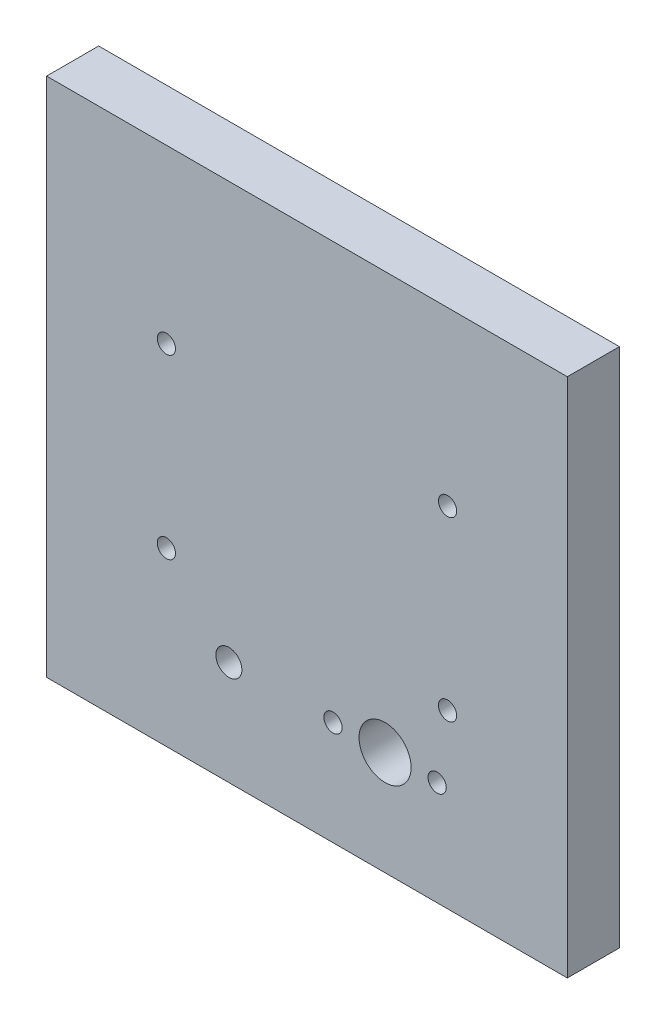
ISO-10303-21;
HEADER;
FILE_DESCRIPTION(('STEP AP214'),'2;1');
FILE_NAME('part.step','',(''),(''),'','','');
FILE_SCHEMA(('AUTOMOTIVE_DESIGN { 1 0 10303 214 1 1 1 1 }'));
ENDSEC;
DATA;
#1=APPLICATION_CONTEXT('core data for automotive mechanical design processes');
#2=APPLICATION_PROTOCOL_DEFINITION('international standard','automotive_design',2000,#1);
#3=PRODUCT_CONTEXT('',#1,'mechanical');
#4=PRODUCT('Part','Part','',(#3));
#5=PRODUCT_RELATED_PRODUCT_CATEGORY('part','',(#4));
#6=PRODUCT_DEFINITION_FORMATION('','',#4);
#7=PRODUCT_DEFINITION_CONTEXT('part definition',#1,'design');
#8=PRODUCT_DEFINITION('design','',#6,#7);
#9=PRODUCT_DEFINITION_SHAPE('','',#8);
#10=(LENGTH_UNIT() NAMED_UNIT(*) SI_UNIT(.MILLI.,.METRE.));
#11=(NAMED_UNIT(*) PLANE_ANGLE_UNIT() SI_UNIT($,.RADIAN.));
#12=(NAMED_UNIT(*) SI_UNIT($,.STERADIAN.) SOLID_ANGLE_UNIT());
#13=UNCERTAINTY_MEASURE_WITH_UNIT(LENGTH_MEASURE(1.E-05),#10,'distance_accuracy_value','');
#14=(GEOMETRIC_REPRESENTATION_CONTEXT(3) GLOBAL_UNCERTAINTY_ASSIGNED_CONTEXT((#13)) GLOBAL_UNIT_ASSIGNED_CONTEXT((#10,
#11,#12)) REPRESENTATION_CONTEXT('',''));
#15=CARTESIAN_POINT('',(0.,0.,0.));
#16=DIRECTION('',(0.,0.,1.));
#17=DIRECTION('',(1.,0.,0.));
#18=AXIS2_PLACEMENT_3D('',#15,#16,#17);
#19=CARTESIAN_POINT('',(0.,0.,10.));
#20=DIRECTION('',(1.,0.,0.));
#21=DIRECTION('',(0.,0.,-1.));
#22=AXIS2_PLACEMENT_3D('',#19,#20,#21);
#23=PLANE('',#22);
#24=DIRECTION('',(0.,-1.,0.));
#25=VECTOR('',#24,1.);
#26=CARTESIAN_POINT('',(0.,0.,0.));
#27=LINE('',#26,#25);
#28=CARTESIAN_POINT('',(0.,100.,0.));
#29=VERTEX_POINT('',#28);
#30=CARTESIAN_POINT('',(0.,0.,0.));
#31=VERTEX_POINT('',#30);
#32=EDGE_CURVE('E98',#29,#31,#27,.T.);
#33=ORIENTED_EDGE('',*,*,#32,.T.);
#34=DIRECTION('',(0.,0.,-1.));
#35=VECTOR('',#34,1.);
#36=CARTESIAN_POINT('',(0.,0.,10.));
#37=LINE('',#36,#35);
#38=CARTESIAN_POINT('',(0.,0.,10.));
#39=VERTEX_POINT('',#38);
#40=EDGE_CURVE('E11',#39,#31,#37,.T.);
#41=ORIENTED_EDGE('',*,*,#40,.F.);
#42=DIRECTION('',(0.,-1.,0.));
#43=VECTOR('',#42,1.);
#44=CARTESIAN_POINT('',(0.,0.,10.));
#45=LINE('',#44,#43);
#46=CARTESIAN_POINT('',(0.,100.,10.));
#47=VERTEX_POINT('',#46);
#48=EDGE_CURVE('E86',#47,#39,#45,.T.);
#49=ORIENTED_EDGE('',*,*,#48,.F.);
#50=DIRECTION('',(0.,0.,-1.));
#51=VECTOR('',#50,1.);
#52=CARTESIAN_POINT('',(0.,100.,10.));
#53=LINE('',#52,#51);
#54=EDGE_CURVE('E94',#47,#29,#53,.T.);
#55=ORIENTED_EDGE('',*,*,#54,.T.);
#56=EDGE_LOOP('',(#33,#41,#49,#55));
#57=FACE_BOUND('',#56,.T.);
#58=ADVANCED_FACE('F35',(#57),#23,.F.);
#59=CARTESIAN_POINT('',(0.,0.,10.));
#60=DIRECTION('',(0.,1.,0.));
#61=DIRECTION('',(0.,0.,1.));
#62=AXIS2_PLACEMENT_3D('',#59,#60,#61);
#63=PLANE('',#62);
#64=DIRECTION('',(1.,0.,0.));
#65=VECTOR('',#64,1.);
#66=CARTESIAN_POINT('',(0.,0.,0.));
#67=LINE('',#66,#65);
#68=CARTESIAN_POINT('',(100.,0.,0.));
#69=VERTEX_POINT('',#68);
#70=EDGE_CURVE('E90',#31,#69,#67,.T.);
#71=ORIENTED_EDGE('',*,*,#70,.T.);
#72=DIRECTION('',(0.,0.,-1.));
#73=VECTOR('',#72,1.);
#74=CARTESIAN_POINT('',(100.,0.,10.));
#75=LINE('',#74,#73);
#76=CARTESIAN_POINT('',(100.,0.,10.));
#77=VERTEX_POINT('',#76);
#78=EDGE_CURVE('E43',#77,#69,#75,.T.);
#79=ORIENTED_EDGE('',*,*,#78,.F.);
#80=DIRECTION('',(1.,0.,0.));
#81=VECTOR('',#80,1.);
#82=CARTESIAN_POINT('',(0.,0.,10.));
#83=LINE('',#82,#81);
#84=EDGE_CURVE('E81',#39,#77,#83,.T.);
#85=ORIENTED_EDGE('',*,*,#84,.F.);
#86=ORIENTED_EDGE('',*,*,#40,.T.);
#87=EDGE_LOOP('',(#71,#79,#85,#86));
#88=FACE_BOUND('',#87,.T.);
#89=ADVANCED_FACE('F89',(#88),#63,.F.);
#90=CARTESIAN_POINT('',(100.,0.,10.));
#91=DIRECTION('',(-1.,0.,0.));
#92=DIRECTION('',(0.,0.,1.));
#93=AXIS2_PLACEMENT_3D('',#90,#91,#92);
#94=PLANE('',#93);
#95=DIRECTION('',(0.,1.,0.));
#96=VECTOR('',#95,1.);
#97=CARTESIAN_POINT('',(100.,0.,0.));
#98=LINE('',#97,#96);
#99=CARTESIAN_POINT('',(100.,100.,0.));
#100=VERTEX_POINT('',#99);
#101=EDGE_CURVE('E68',#69,#100,#98,.T.);
#102=ORIENTED_EDGE('',*,*,#101,.T.);
#103=DIRECTION('',(0.,0.,-1.));
#104=VECTOR('',#103,1.);
#105=CARTESIAN_POINT('',(100.,100.,10.));
#106=LINE('',#105,#104);
#107=CARTESIAN_POINT('',(100.,100.,10.));
#108=VERTEX_POINT('',#107);
#109=EDGE_CURVE('E91',#108,#100,#106,.T.);
#110=ORIENTED_EDGE('',*,*,#109,.F.);
#111=DIRECTION('',(0.,1.,0.));
#112=VECTOR('',#111,1.);
#113=CARTESIAN_POINT('',(100.,0.,10.));
#114=LINE('',#113,#112);
#115=EDGE_CURVE('E84',#77,#108,#114,.T.);
#116=ORIENTED_EDGE('',*,*,#115,.F.);
#117=ORIENTED_EDGE('',*,*,#78,.T.);
#118=EDGE_LOOP('',(#102,#110,#116,#117));
#119=FACE_BOUND('',#118,.T.);
#120=ADVANCED_FACE('F92',(#119),#94,.F.);
#121=CARTESIAN_POINT('',(0.,100.,10.));
#122=DIRECTION('',(0.,-1.,0.));
#123=DIRECTION('',(0.,0.,-1.));
#124=AXIS2_PLACEMENT_3D('',#121,#122,#123);
#125=PLANE('',#124);
#126=DIRECTION('',(-1.,0.,0.));
#127=VECTOR('',#126,1.);
#128=CARTESIAN_POINT('',(0.,100.,0.));
#129=LINE('',#128,#127);
#130=EDGE_CURVE('E74',#100,#29,#129,.T.);
#131=ORIENTED_EDGE('',*,*,#130,.T.);
#132=ORIENTED_EDGE('',*,*,#54,.F.);
#133=DIRECTION('',(-1.,0.,0.));
#134=VECTOR('',#133,1.);
#135=CARTESIAN_POINT('',(0.,100.,10.));
#136=LINE('',#135,#134);
#137=EDGE_CURVE('E51',#108,#47,#136,.T.);
#138=ORIENTED_EDGE('',*,*,#137,.F.);
#139=ORIENTED_EDGE('',*,*,#109,.T.);
#140=EDGE_LOOP('',(#131,#132,#138,#139));
#141=FACE_BOUND('',#140,.T.);
#142=ADVANCED_FACE('F106',(#141),#125,.F.);
#143=CARTESIAN_POINT('',(0.,0.,10.));
#144=DIRECTION('',(0.,0.,-1.));
#145=DIRECTION('',(-1.,0.,0.));
#146=AXIS2_PLACEMENT_3D('',#143,#144,#145);
#147=PLANE('',#146);
#148=CARTESIAN_POINT('',(75.,20.,10.));
#149=DIRECTION('',(0.,0.,1.));
#150=DIRECTION('',(1.,0.,0.));
#151=AXIS2_PLACEMENT_3D('',#148,#149,#150);
#152=CIRCLE('',#151,1.75);
#153=CARTESIAN_POINT('',(76.75,20.,10.));
#154=VERTEX_POINT('',#153);
#155=EDGE_CURVE('E154',#154,#154,#152,.T.);
#156=ORIENTED_EDGE('',*,*,#155,.F.);
#157=EDGE_LOOP('',(#156));
#158=FACE_BOUND('',#157,.T.);
#159=CARTESIAN_POINT('',(55.,20.,10.));
#160=DIRECTION('',(0.,0.,1.));
#161=DIRECTION('',(1.,0.,0.));
#162=AXIS2_PLACEMENT_3D('',#159,#160,#161);
#163=CIRCLE('',#162,1.75);
#164=CARTESIAN_POINT('',(56.75,20.,10.));
#165=VERTEX_POINT('',#164);
#166=EDGE_CURVE('E148',#165,#165,#163,.T.);
#167=ORIENTED_EDGE('',*,*,#166,.F.);
#168=EDGE_LOOP('',(#167));
#169=FACE_BOUND('',#168,.T.);
#170=CARTESIAN_POINT('',(65.,20.,10.));
#171=DIRECTION('',(0.,0.,1.));
#172=DIRECTION('',(1.,0.,0.));
#173=AXIS2_PLACEMENT_3D('',#170,#171,#172);
#174=CIRCLE('',#173,5.);
#175=CARTESIAN_POINT('',(70.,20.,10.));
#176=VERTEX_POINT('',#175);
#177=EDGE_CURVE('E142',#176,#176,#174,.T.);
#178=ORIENTED_EDGE('',*,*,#177,.F.);
#179=EDGE_LOOP('',(#178));
#180=FACE_BOUND('',#179,.T.);
#181=CARTESIAN_POINT('',(35.,20.,10.));
#182=DIRECTION('',(0.,0.,1.));
#183=DIRECTION('',(1.,0.,0.));
#184=AXIS2_PLACEMENT_3D('',#181,#182,#183);
#185=CIRCLE('',#184,2.49999999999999);
#186=CARTESIAN_POINT('',(37.5,20.,10.));
#187=VERTEX_POINT('',#186);
#188=EDGE_CURVE('E136',#187,#187,#185,.T.);
#189=ORIENTED_EDGE('',*,*,#188,.F.);
#190=EDGE_LOOP('',(#189));
#191=FACE_BOUND('',#190,.T.);
#192=CARTESIAN_POINT('',(77.,33.,10.));
#193=DIRECTION('',(0.,0.,1.));
#194=DIRECTION('',(1.,0.,0.));
#195=AXIS2_PLACEMENT_3D('',#192,#193,#194);
#196=CIRCLE('',#195,1.75);
#197=CARTESIAN_POINT('',(78.75,33.,10.));
#198=VERTEX_POINT('',#197);
#199=EDGE_CURVE('E130',#198,#198,#196,.T.);
#200=ORIENTED_EDGE('',*,*,#199,.F.);
#201=EDGE_LOOP('',(#200));
#202=FACE_BOUND('',#201,.T.);
#203=CARTESIAN_POINT('',(23.,33.,10.));
#204=DIRECTION('',(0.,0.,1.));
#205=DIRECTION('',(1.,0.,0.));
#206=AXIS2_PLACEMENT_3D('',#203,#204,#205);
#207=CIRCLE('',#206,1.75);
#208=CARTESIAN_POINT('',(24.75,33.,10.));
#209=VERTEX_POINT('',#208);
#210=EDGE_CURVE('E124',#209,#209,#207,.T.);
#211=ORIENTED_EDGE('',*,*,#210,.F.);
#212=EDGE_LOOP('',(#211));
#213=FACE_BOUND('',#212,.T.);
#214=CARTESIAN_POINT('',(77.,67.,10.));
#215=DIRECTION('',(0.,0.,1.));
#216=DIRECTION('',(1.,0.,0.));
#217=AXIS2_PLACEMENT_3D('',#214,#215,#216);
#218=CIRCLE('',#217,1.75);
#219=CARTESIAN_POINT('',(78.75,67.,10.));
#220=VERTEX_POINT('',#219);
#221=EDGE_CURVE('E118',#220,#220,#218,.T.);
#222=ORIENTED_EDGE('',*,*,#221,.F.);
#223=EDGE_LOOP('',(#222));
#224=FACE_BOUND('',#223,.T.);
#225=CARTESIAN_POINT('',(23.,67.,10.));
#226=DIRECTION('',(0.,0.,1.));
#227=DIRECTION('',(1.,0.,0.));
#228=AXIS2_PLACEMENT_3D('',#225,#226,#227);
#229=CIRCLE('',#228,1.75);
#230=CARTESIAN_POINT('',(24.75,67.,10.));
#231=VERTEX_POINT('',#230);
#232=EDGE_CURVE('E112',#231,#231,#229,.T.);
#233=ORIENTED_EDGE('',*,*,#232,.F.);
#234=EDGE_LOOP('',(#233));
#235=FACE_BOUND('',#234,.T.);
#236=ORIENTED_EDGE('',*,*,#48,.T.);
#237=ORIENTED_EDGE('',*,*,#84,.T.);
#238=ORIENTED_EDGE('',*,*,#115,.T.);
#239=ORIENTED_EDGE('',*,*,#137,.T.);
#240=EDGE_LOOP('',(#236,#237,#238,#239));
#241=FACE_BOUND('',#240,.T.);
#242=ADVANCED_FACE('F82',(#158,#169,#180,#191,#202,#213,#224,#235,#241),#147,.F.);
#243=CARTESIAN_POINT('',(0.,0.,0.));
#244=DIRECTION('',(0.,0.,-1.));
#245=DIRECTION('',(-1.,0.,0.));
#246=AXIS2_PLACEMENT_3D('',#243,#244,#245);
#247=PLANE('',#246);
#248=CARTESIAN_POINT('',(75.,20.,0.));
#249=DIRECTION('',(0.,0.,1.));
#250=DIRECTION('',(1.,0.,0.));
#251=AXIS2_PLACEMENT_3D('',#248,#249,#250);
#252=CIRCLE('',#251,1.75);
#253=CARTESIAN_POINT('',(76.75,20.,0.));
#254=VERTEX_POINT('',#253);
#255=EDGE_CURVE('E151',#254,#254,#252,.T.);
#256=ORIENTED_EDGE('',*,*,#255,.T.);
#257=EDGE_LOOP('',(#256));
#258=FACE_BOUND('',#257,.T.);
#259=CARTESIAN_POINT('',(55.,20.,0.));
#260=DIRECTION('',(0.,0.,1.));
#261=DIRECTION('',(1.,0.,0.));
#262=AXIS2_PLACEMENT_3D('',#259,#260,#261);
#263=CIRCLE('',#262,1.75);
#264=CARTESIAN_POINT('',(56.75,20.,0.));
#265=VERTEX_POINT('',#264);
#266=EDGE_CURVE('E145',#265,#265,#263,.T.);
#267=ORIENTED_EDGE('',*,*,#266,.T.);
#268=EDGE_LOOP('',(#267));
#269=FACE_BOUND('',#268,.T.);
#270=CARTESIAN_POINT('',(65.,20.,0.));
#271=DIRECTION('',(0.,0.,1.));
#272=DIRECTION('',(1.,0.,0.));
#273=AXIS2_PLACEMENT_3D('',#270,#271,#272);
#274=CIRCLE('',#273,5.);
#275=CARTESIAN_POINT('',(70.,20.,0.));
#276=VERTEX_POINT('',#275);
#277=EDGE_CURVE('E139',#276,#276,#274,.T.);
#278=ORIENTED_EDGE('',*,*,#277,.T.);
#279=EDGE_LOOP('',(#278));
#280=FACE_BOUND('',#279,.T.);
#281=CARTESIAN_POINT('',(35.,20.,0.));
#282=DIRECTION('',(0.,0.,1.));
#283=DIRECTION('',(1.,0.,0.));
#284=AXIS2_PLACEMENT_3D('',#281,#282,#283);
#285=CIRCLE('',#284,2.49999999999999);
#286=CARTESIAN_POINT('',(37.5,20.,0.));
#287=VERTEX_POINT('',#286);
#288=EDGE_CURVE('E133',#287,#287,#285,.T.);
#289=ORIENTED_EDGE('',*,*,#288,.T.);
#290=EDGE_LOOP('',(#289));
#291=FACE_BOUND('',#290,.T.);
#292=ORIENTED_EDGE('',*,*,#32,.F.);
#293=ORIENTED_EDGE('',*,*,#130,.F.);
#294=ORIENTED_EDGE('',*,*,#101,.F.);
#295=ORIENTED_EDGE('',*,*,#70,.F.);
#296=EDGE_LOOP('',(#292,#293,#294,#295));
#297=FACE_BOUND('',#296,.T.);
#298=ADVANCED_FACE('F109',(#258,#269,#280,#291,#297),#247,.T.);
#299=CARTESIAN_POINT('',(23.,67.,2.));
#300=DIRECTION('',(0.,0.,1.));
#301=DIRECTION('',(1.,0.,0.));
#302=AXIS2_PLACEMENT_3D('',#299,#300,#301);
#303=CYLINDRICAL_SURFACE('',#302,1.75);
#304=CARTESIAN_POINT('',(23.,67.,2.));
#305=DIRECTION('',(0.,0.,1.));
#306=DIRECTION('',(1.,0.,0.));
#307=AXIS2_PLACEMENT_3D('',#304,#305,#306);
#308=CIRCLE('',#307,1.75);
#309=CARTESIAN_POINT('',(24.75,67.,2.));
#310=VERTEX_POINT('',#309);
#311=EDGE_CURVE('E101',#310,#310,#308,.T.);
#312=ORIENTED_EDGE('',*,*,#311,.F.);
#313=EDGE_LOOP('',(#312));
#314=FACE_BOUND('',#313,.T.);
#315=ORIENTED_EDGE('',*,*,#232,.T.);
#316=EDGE_LOOP('',(#315));
#317=FACE_BOUND('',#316,.T.);
#318=ADVANCED_FACE('F186',(#314,#317),#303,.F.);
#319=CARTESIAN_POINT('',(23.,67.,2.));
#320=DIRECTION('',(0.,0.,1.));
#321=DIRECTION('',(1.,0.,0.));
#322=AXIS2_PLACEMENT_3D('',#319,#320,#321);
#323=PLANE('',#322);
#324=ORIENTED_EDGE('',*,*,#311,.T.);
#325=EDGE_LOOP('',(#324));
#326=FACE_BOUND('',#325,.T.);
#327=ADVANCED_FACE('F188',(#326),#323,.T.);
#328=CARTESIAN_POINT('',(77.,67.,2.));
#329=DIRECTION('',(0.,0.,1.));
#330=DIRECTION('',(1.,0.,0.));
#331=AXIS2_PLACEMENT_3D('',#328,#329,#330);
#332=CYLINDRICAL_SURFACE('',#331,1.75);
#333=CARTESIAN_POINT('',(77.,67.,2.));
#334=DIRECTION('',(0.,0.,1.));
#335=DIRECTION('',(1.,0.,0.));
#336=AXIS2_PLACEMENT_3D('',#333,#334,#335);
#337=CIRCLE('',#336,1.75);
#338=CARTESIAN_POINT('',(78.75,67.,2.));
#339=VERTEX_POINT('',#338);
#340=EDGE_CURVE('E115',#339,#339,#337,.T.);
#341=ORIENTED_EDGE('',*,*,#340,.F.);
#342=EDGE_LOOP('',(#341));
#343=FACE_BOUND('',#342,.T.);
#344=ORIENTED_EDGE('',*,*,#221,.T.);
#345=EDGE_LOOP('',(#344));
#346=FACE_BOUND('',#345,.T.);
#347=ADVANCED_FACE('F195',(#343,#346),#332,.F.);
#348=CARTESIAN_POINT('',(77.,67.,2.));
#349=DIRECTION('',(0.,0.,1.));
#350=DIRECTION('',(1.,0.,0.));
#351=AXIS2_PLACEMENT_3D('',#348,#349,#350);
#352=PLANE('',#351);
#353=ORIENTED_EDGE('',*,*,#340,.T.);
#354=EDGE_LOOP('',(#353));
#355=FACE_BOUND('',#354,.T.);
#356=ADVANCED_FACE('F282',(#355),#352,.T.);
#357=CARTESIAN_POINT('',(23.,33.,2.));
#358=DIRECTION('',(0.,0.,1.));
#359=DIRECTION('',(1.,0.,0.));
#360=AXIS2_PLACEMENT_3D('',#357,#358,#359);
#361=CYLINDRICAL_SURFACE('',#360,1.75);
#362=CARTESIAN_POINT('',(23.,33.,2.));
#363=DIRECTION('',(0.,0.,1.));
#364=DIRECTION('',(1.,0.,0.));
#365=AXIS2_PLACEMENT_3D('',#362,#363,#364);
#366=CIRCLE('',#365,1.75);
#367=CARTESIAN_POINT('',(24.75,33.,2.));
#368=VERTEX_POINT('',#367);
#369=EDGE_CURVE('E121',#368,#368,#366,.T.);
#370=ORIENTED_EDGE('',*,*,#369,.F.);
#371=EDGE_LOOP('',(#370));
#372=FACE_BOUND('',#371,.T.);
#373=ORIENTED_EDGE('',*,*,#210,.T.);
#374=EDGE_LOOP('',(#373));
#375=FACE_BOUND('',#374,.T.);
#376=ADVANCED_FACE('F278',(#372,#375),#361,.F.);
#377=CARTESIAN_POINT('',(23.,33.,2.));
#378=DIRECTION('',(0.,0.,1.));
#379=DIRECTION('',(1.,0.,0.));
#380=AXIS2_PLACEMENT_3D('',#377,#378,#379);
#381=PLANE('',#380);
#382=ORIENTED_EDGE('',*,*,#369,.T.);
#383=EDGE_LOOP('',(#382));
#384=FACE_BOUND('',#383,.T.);
#385=ADVANCED_FACE('F274',(#384),#381,.T.);
#386=CARTESIAN_POINT('',(77.,33.,2.));
#387=DIRECTION('',(0.,0.,1.));
#388=DIRECTION('',(1.,0.,0.));
#389=AXIS2_PLACEMENT_3D('',#386,#387,#388);
#390=CYLINDRICAL_SURFACE('',#389,1.75);
#391=CARTESIAN_POINT('',(77.,33.,2.));
#392=DIRECTION('',(0.,0.,1.));
#393=DIRECTION('',(1.,0.,0.));
#394=AXIS2_PLACEMENT_3D('',#391,#392,#393);
#395=CIRCLE('',#394,1.75);
#396=CARTESIAN_POINT('',(78.75,33.,2.));
#397=VERTEX_POINT('',#396);
#398=EDGE_CURVE('E127',#397,#397,#395,.T.);
#399=ORIENTED_EDGE('',*,*,#398,.F.);
#400=EDGE_LOOP('',(#399));
#401=FACE_BOUND('',#400,.T.);
#402=ORIENTED_EDGE('',*,*,#199,.T.);
#403=EDGE_LOOP('',(#402));
#404=FACE_BOUND('',#403,.T.);
#405=ADVANCED_FACE('F270',(#401,#404),#390,.F.);
#406=CARTESIAN_POINT('',(77.,33.,2.));
#407=DIRECTION('',(0.,0.,1.));
#408=DIRECTION('',(1.,0.,0.));
#409=AXIS2_PLACEMENT_3D('',#406,#407,#408);
#410=PLANE('',#409);
#411=ORIENTED_EDGE('',*,*,#398,.T.);
#412=EDGE_LOOP('',(#411));
#413=FACE_BOUND('',#412,.T.);
#414=ADVANCED_FACE('F235',(#413),#410,.T.);
#415=CARTESIAN_POINT('',(35.,20.,0.));
#416=DIRECTION('',(0.,0.,1.));
#417=DIRECTION('',(1.,0.,0.));
#418=AXIS2_PLACEMENT_3D('',#415,#416,#417);
#419=CYLINDRICAL_SURFACE('',#418,2.49999999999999);
#420=ORIENTED_EDGE('',*,*,#288,.F.);
#421=EDGE_LOOP('',(#420));
#422=FACE_BOUND('',#421,.T.);
#423=ORIENTED_EDGE('',*,*,#188,.T.);
#424=EDGE_LOOP('',(#423));
#425=FACE_BOUND('',#424,.T.);
#426=ADVANCED_FACE('F229',(#422,#425),#419,.F.);
#427=CARTESIAN_POINT('',(65.,20.,0.));
#428=DIRECTION('',(0.,0.,1.));
#429=DIRECTION('',(1.,0.,0.));
#430=AXIS2_PLACEMENT_3D('',#427,#428,#429);
#431=CYLINDRICAL_SURFACE('',#430,5.);
#432=ORIENTED_EDGE('',*,*,#277,.F.);
#433=EDGE_LOOP('',(#432));
#434=FACE_BOUND('',#433,.T.);
#435=ORIENTED_EDGE('',*,*,#177,.T.);
#436=EDGE_LOOP('',(#435));
#437=FACE_BOUND('',#436,.T.);
#438=ADVANCED_FACE('F234',(#434,#437),#431,.F.);
#439=CARTESIAN_POINT('',(55.,20.,0.));
#440=DIRECTION('',(0.,0.,1.));
#441=DIRECTION('',(1.,0.,0.));
#442=AXIS2_PLACEMENT_3D('',#439,#440,#441);
#443=CYLINDRICAL_SURFACE('',#442,1.75);
#444=ORIENTED_EDGE('',*,*,#266,.F.);
#445=EDGE_LOOP('',(#444));
#446=FACE_BOUND('',#445,.T.);
#447=ORIENTED_EDGE('',*,*,#166,.T.);
#448=EDGE_LOOP('',(#447));
#449=FACE_BOUND('',#448,.T.);
#450=ADVANCED_FACE('F165',(#446,#449),#443,.F.);
#451=CARTESIAN_POINT('',(75.,20.,0.));
#452=DIRECTION('',(0.,0.,1.));
#453=DIRECTION('',(1.,0.,0.));
#454=AXIS2_PLACEMENT_3D('',#451,#452,#453);
#455=CYLINDRICAL_SURFACE('',#454,1.75);
#456=ORIENTED_EDGE('',*,*,#255,.F.);
#457=EDGE_LOOP('',(#456));
#458=FACE_BOUND('',#457,.T.);
#459=ORIENTED_EDGE('',*,*,#155,.T.);
#460=EDGE_LOOP('',(#459));
#461=FACE_BOUND('',#460,.T.);
#462=ADVANCED_FACE('F162',(#458,#461),#455,.F.);
#463=CLOSED_SHELL('',(#58,#89,#120,#142,#242,#298,#318,#327,#347,#356,#376,#385,#405,#414,#426,
#438,#450,#462));
#464=MANIFOLD_SOLID_BREP('B2',#463);
#465=ADVANCED_BREP_SHAPE_REPRESENTATION('',(#18,#464),#14);
#466=SHAPE_DEFINITION_REPRESENTATION(#9,#465);
ENDSEC;
END-ISO-10303-21;
